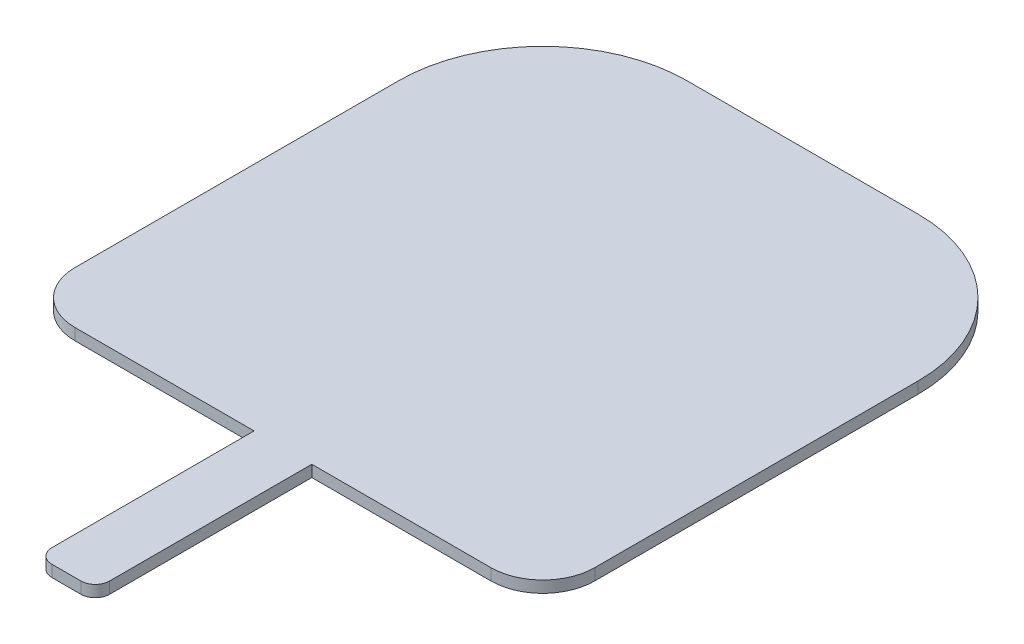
ISO-10303-21;
HEADER;
FILE_DESCRIPTION(('STEP AP214'),'2;1');
FILE_NAME('part.step','',(''),(''),'','','');
FILE_SCHEMA(('AUTOMOTIVE_DESIGN { 1 0 10303 214 1 1 1 1 }'));
ENDSEC;
DATA;
#1=APPLICATION_CONTEXT('core data for automotive mechanical design processes');
#2=APPLICATION_PROTOCOL_DEFINITION('international standard','automotive_design',2000,#1);
#3=PRODUCT_CONTEXT('',#1,'mechanical');
#4=PRODUCT('Part','Part','',(#3));
#5=PRODUCT_RELATED_PRODUCT_CATEGORY('part','',(#4));
#6=PRODUCT_DEFINITION_FORMATION('','',#4);
#7=PRODUCT_DEFINITION_CONTEXT('part definition',#1,'design');
#8=PRODUCT_DEFINITION('design','',#6,#7);
#9=PRODUCT_DEFINITION_SHAPE('','',#8);
#10=(LENGTH_UNIT() NAMED_UNIT(*) SI_UNIT(.MILLI.,.METRE.));
#11=(NAMED_UNIT(*) PLANE_ANGLE_UNIT() SI_UNIT($,.RADIAN.));
#12=(NAMED_UNIT(*) SI_UNIT($,.STERADIAN.) SOLID_ANGLE_UNIT());
#13=UNCERTAINTY_MEASURE_WITH_UNIT(LENGTH_MEASURE(1.E-05),#10,'distance_accuracy_value','');
#14=(GEOMETRIC_REPRESENTATION_CONTEXT(3) GLOBAL_UNCERTAINTY_ASSIGNED_CONTEXT((#13)) GLOBAL_UNIT_ASSIGNED_CONTEXT((#10,
#11,#12)) REPRESENTATION_CONTEXT('',''));
#15=CARTESIAN_POINT('',(0.,0.,0.));
#16=DIRECTION('',(0.,0.,1.));
#17=DIRECTION('',(1.,0.,0.));
#18=AXIS2_PLACEMENT_3D('',#15,#16,#17);
#19=CARTESIAN_POINT('',(-180.,8.,180.));
#20=DIRECTION('',(0.,0.,-1.));
#21=DIRECTION('',(-1.,0.,0.));
#22=AXIS2_PLACEMENT_3D('',#19,#20,#21);
#23=PLANE('',#22);
#24=DIRECTION('',(1.,0.,0.));
#25=VECTOR('',#24,1.);
#26=CARTESIAN_POINT('',(-180.,8.,180.));
#27=LINE('',#26,#25);
#28=CARTESIAN_POINT('',(-144.,8.,180.));
#29=VERTEX_POINT('',#28);
#30=CARTESIAN_POINT('',(-20.,8.,180.));
#31=VERTEX_POINT('',#30);
#32=EDGE_CURVE('E162',#29,#31,#27,.T.);
#33=ORIENTED_EDGE('',*,*,#32,.F.);
#34=DIRECTION('',(0.,-1.,0.));
#35=VECTOR('',#34,1.);
#36=CARTESIAN_POINT('',(-144.,8.,180.));
#37=LINE('',#36,#35);
#38=CARTESIAN_POINT('',(-144.,0.,180.));
#39=VERTEX_POINT('',#38);
#40=EDGE_CURVE('E189',#29,#39,#37,.T.);
#41=ORIENTED_EDGE('',*,*,#40,.T.);
#42=DIRECTION('',(1.,0.,0.));
#43=VECTOR('',#42,1.);
#44=CARTESIAN_POINT('',(-180.,0.,180.));
#45=LINE('',#44,#43);
#46=CARTESIAN_POINT('',(-20.,0.,180.));
#47=VERTEX_POINT('',#46);
#48=EDGE_CURVE('E212',#39,#47,#45,.T.);
#49=ORIENTED_EDGE('',*,*,#48,.T.);
#50=DIRECTION('',(0.,-1.,0.));
#51=VECTOR('',#50,1.);
#52=CARTESIAN_POINT('',(-20.,8.,180.));
#53=LINE('',#52,#51);
#54=EDGE_CURVE('E146',#31,#47,#53,.T.);
#55=ORIENTED_EDGE('',*,*,#54,.F.);
#56=EDGE_LOOP('',(#33,#41,#49,#55));
#57=FACE_BOUND('',#56,.T.);
#58=ADVANCED_FACE('F33',(#57),#23,.F.);
#59=CARTESIAN_POINT('',(180.,8.,180.));
#60=DIRECTION('',(-1.,0.,0.));
#61=DIRECTION('',(0.,0.,1.));
#62=AXIS2_PLACEMENT_3D('',#59,#60,#61);
#63=PLANE('',#62);
#64=DIRECTION('',(0.,0.,-1.));
#65=VECTOR('',#64,1.);
#66=CARTESIAN_POINT('',(180.,8.,180.));
#67=LINE('',#66,#65);
#68=CARTESIAN_POINT('',(180.,8.,144.));
#69=VERTEX_POINT('',#68);
#70=CARTESIAN_POINT('',(180.,8.,-79.9999999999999));
#71=VERTEX_POINT('',#70);
#72=EDGE_CURVE('E211',#69,#71,#67,.T.);
#73=ORIENTED_EDGE('',*,*,#72,.F.);
#74=DIRECTION('',(0.,-1.,0.));
#75=VECTOR('',#74,1.);
#76=CARTESIAN_POINT('',(180.,8.,144.));
#77=LINE('',#76,#75);
#78=CARTESIAN_POINT('',(180.,0.,144.));
#79=VERTEX_POINT('',#78);
#80=EDGE_CURVE('E236',#69,#79,#77,.T.);
#81=ORIENTED_EDGE('',*,*,#80,.T.);
#82=DIRECTION('',(0.,0.,-1.));
#83=VECTOR('',#82,1.);
#84=CARTESIAN_POINT('',(180.,0.,180.));
#85=LINE('',#84,#83);
#86=CARTESIAN_POINT('',(180.,0.,-79.9999999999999));
#87=VERTEX_POINT('',#86);
#88=EDGE_CURVE('E157',#79,#87,#85,.T.);
#89=ORIENTED_EDGE('',*,*,#88,.T.);
#90=DIRECTION('',(0.,-1.,0.));
#91=VECTOR('',#90,1.);
#92=CARTESIAN_POINT('',(180.,8.,-80.));
#93=LINE('',#92,#91);
#94=EDGE_CURVE('E229',#87,#71,#93,.F.);
#95=ORIENTED_EDGE('',*,*,#94,.T.);
#96=EDGE_LOOP('',(#73,#81,#89,#95));
#97=FACE_BOUND('',#96,.T.);
#98=ADVANCED_FACE('F271',(#97),#63,.F.);
#99=CARTESIAN_POINT('',(-180.,8.,-180.));
#100=DIRECTION('',(0.,0.,1.));
#101=DIRECTION('',(1.,0.,0.));
#102=AXIS2_PLACEMENT_3D('',#99,#100,#101);
#103=PLANE('',#102);
#104=DIRECTION('',(-1.,0.,0.));
#105=VECTOR('',#104,1.);
#106=CARTESIAN_POINT('',(-180.,8.,-180.));
#107=LINE('',#106,#105);
#108=CARTESIAN_POINT('',(79.9999999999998,8.,-180.));
#109=VERTEX_POINT('',#108);
#110=CARTESIAN_POINT('',(-80.0000000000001,8.,-180.));
#111=VERTEX_POINT('',#110);
#112=EDGE_CURVE('E168',#109,#111,#107,.T.);
#113=ORIENTED_EDGE('',*,*,#112,.F.);
#114=DIRECTION('',(0.,-1.,0.));
#115=VECTOR('',#114,1.);
#116=CARTESIAN_POINT('',(80.,8.,-180.));
#117=LINE('',#116,#115);
#118=CARTESIAN_POINT('',(79.9999999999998,0.,-180.));
#119=VERTEX_POINT('',#118);
#120=EDGE_CURVE('E259',#109,#119,#117,.T.);
#121=ORIENTED_EDGE('',*,*,#120,.T.);
#122=DIRECTION('',(-1.,0.,0.));
#123=VECTOR('',#122,1.);
#124=CARTESIAN_POINT('',(-180.,0.,-180.));
#125=LINE('',#124,#123);
#126=CARTESIAN_POINT('',(-80.0000000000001,0.,-180.));
#127=VERTEX_POINT('',#126);
#128=EDGE_CURVE('E268',#119,#127,#125,.T.);
#129=ORIENTED_EDGE('',*,*,#128,.T.);
#130=DIRECTION('',(0.,-1.,0.));
#131=VECTOR('',#130,1.);
#132=CARTESIAN_POINT('',(-80.,8.,-180.));
#133=LINE('',#132,#131);
#134=EDGE_CURVE('E165',#127,#111,#133,.F.);
#135=ORIENTED_EDGE('',*,*,#134,.T.);
#136=EDGE_LOOP('',(#113,#121,#129,#135));
#137=FACE_BOUND('',#136,.T.);
#138=ADVANCED_FACE('F294',(#137),#103,.F.);
#139=CARTESIAN_POINT('',(-180.,8.,180.));
#140=DIRECTION('',(1.,0.,0.));
#141=DIRECTION('',(0.,0.,-1.));
#142=AXIS2_PLACEMENT_3D('',#139,#140,#141);
#143=PLANE('',#142);
#144=DIRECTION('',(0.,0.,1.));
#145=VECTOR('',#144,1.);
#146=CARTESIAN_POINT('',(-180.,0.,180.));
#147=LINE('',#146,#145);
#148=CARTESIAN_POINT('',(-180.,0.,-79.9999999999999));
#149=VERTEX_POINT('',#148);
#150=CARTESIAN_POINT('',(-180.,0.,144.));
#151=VERTEX_POINT('',#150);
#152=EDGE_CURVE('E256',#149,#151,#147,.T.);
#153=ORIENTED_EDGE('',*,*,#152,.T.);
#154=DIRECTION('',(0.,-1.,0.));
#155=VECTOR('',#154,1.);
#156=CARTESIAN_POINT('',(-180.,8.,144.));
#157=LINE('',#156,#155);
#158=CARTESIAN_POINT('',(-180.,8.,144.));
#159=VERTEX_POINT('',#158);
#160=EDGE_CURVE('E192',#151,#159,#157,.F.);
#161=ORIENTED_EDGE('',*,*,#160,.T.);
#162=DIRECTION('',(0.,0.,1.));
#163=VECTOR('',#162,1.);
#164=CARTESIAN_POINT('',(-180.,8.,180.));
#165=LINE('',#164,#163);
#166=CARTESIAN_POINT('',(-180.,8.,-79.9999999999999));
#167=VERTEX_POINT('',#166);
#168=EDGE_CURVE('E163',#167,#159,#165,.T.);
#169=ORIENTED_EDGE('',*,*,#168,.F.);
#170=DIRECTION('',(0.,-1.,0.));
#171=VECTOR('',#170,1.);
#172=CARTESIAN_POINT('',(-180.,8.,-80.));
#173=LINE('',#172,#171);
#174=EDGE_CURVE('E228',#167,#149,#173,.T.);
#175=ORIENTED_EDGE('',*,*,#174,.T.);
#176=EDGE_LOOP('',(#153,#161,#169,#175));
#177=FACE_BOUND('',#176,.T.);
#178=ADVANCED_FACE('F300',(#177),#143,.F.);
#179=CARTESIAN_POINT('',(19.9999999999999,0.,180.));
#180=VERTEX_POINT('',#179);
#181=CARTESIAN_POINT('',(144.,0.,180.));
#182=VERTEX_POINT('',#181);
#183=EDGE_CURVE('E172',#180,#182,#45,.T.);
#184=ORIENTED_EDGE('',*,*,#183,.T.);
#185=DIRECTION('',(0.,-1.,0.));
#186=VECTOR('',#185,1.);
#187=CARTESIAN_POINT('',(144.,8.,180.));
#188=LINE('',#187,#186);
#189=CARTESIAN_POINT('',(144.,8.,180.));
#190=VERTEX_POINT('',#189);
#191=EDGE_CURVE('E161',#182,#190,#188,.F.);
#192=ORIENTED_EDGE('',*,*,#191,.T.);
#193=CARTESIAN_POINT('',(19.9999999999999,8.,180.));
#194=VERTEX_POINT('',#193);
#195=EDGE_CURVE('E140',#194,#190,#27,.T.);
#196=ORIENTED_EDGE('',*,*,#195,.F.);
#197=DIRECTION('',(0.,-1.,0.));
#198=VECTOR('',#197,1.);
#199=CARTESIAN_POINT('',(19.9999999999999,8.,180.));
#200=LINE('',#199,#198);
#201=EDGE_CURVE('E150',#194,#180,#200,.T.);
#202=ORIENTED_EDGE('',*,*,#201,.T.);
#203=EDGE_LOOP('',(#184,#192,#196,#202));
#204=FACE_BOUND('',#203,.T.);
#205=ADVANCED_FACE('F159',(#204),#23,.F.);
#206=CARTESIAN_POINT('',(0.,8.,0.));
#207=DIRECTION('',(0.,-1.,0.));
#208=DIRECTION('',(0.,0.,-1.));
#209=AXIS2_PLACEMENT_3D('',#206,#207,#208);
#210=PLANE('',#209);
#211=DIRECTION('',(1.,0.,0.));
#212=VECTOR('',#211,1.);
#213=CARTESIAN_POINT('',(-20.,8.,330.));
#214=LINE('',#213,#212);
#215=CARTESIAN_POINT('',(-10.,8.,330.));
#216=VERTEX_POINT('',#215);
#217=CARTESIAN_POINT('',(9.99999999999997,8.,330.));
#218=VERTEX_POINT('',#217);
#219=EDGE_CURVE('E147',#216,#218,#214,.T.);
#220=ORIENTED_EDGE('',*,*,#219,.T.);
#221=CARTESIAN_POINT('',(9.99999999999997,8.,320.));
#222=DIRECTION('',(0.,-1.,0.));
#223=DIRECTION('',(0.,0.,-1.));
#224=AXIS2_PLACEMENT_3D('',#221,#222,#223);
#225=CIRCLE('',#224,10.);
#226=CARTESIAN_POINT('',(20.,8.,320.));
#227=VERTEX_POINT('',#226);
#228=EDGE_CURVE('E41',#218,#227,#225,.F.);
#229=ORIENTED_EDGE('',*,*,#228,.T.);
#230=DIRECTION('',(0.,0.,-1.));
#231=VECTOR('',#230,1.);
#232=CARTESIAN_POINT('',(19.9999999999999,8.,180.));
#233=LINE('',#232,#231);
#234=EDGE_CURVE('E136',#227,#194,#233,.T.);
#235=ORIENTED_EDGE('',*,*,#234,.T.);
#236=ORIENTED_EDGE('',*,*,#195,.T.);
#237=CARTESIAN_POINT('',(144.,8.,144.));
#238=DIRECTION('',(0.,-1.,0.));
#239=DIRECTION('',(0.,0.,-1.));
#240=AXIS2_PLACEMENT_3D('',#237,#238,#239);
#241=CIRCLE('',#240,36.);
#242=EDGE_CURVE('E187',#190,#69,#241,.F.);
#243=ORIENTED_EDGE('',*,*,#242,.T.);
#244=ORIENTED_EDGE('',*,*,#72,.T.);
#245=CARTESIAN_POINT('',(80.,8.,-80.));
#246=DIRECTION('',(0.,-1.,0.));
#247=DIRECTION('',(0.,0.,-1.));
#248=AXIS2_PLACEMENT_3D('',#245,#246,#247);
#249=CIRCLE('',#248,100.);
#250=EDGE_CURVE('E219',#71,#109,#249,.F.);
#251=ORIENTED_EDGE('',*,*,#250,.T.);
#252=ORIENTED_EDGE('',*,*,#112,.T.);
#253=CARTESIAN_POINT('',(-80.,8.,-80.));
#254=DIRECTION('',(0.,-1.,0.));
#255=DIRECTION('',(0.,0.,-1.));
#256=AXIS2_PLACEMENT_3D('',#253,#254,#255);
#257=CIRCLE('',#256,100.);
#258=EDGE_CURVE('E216',#111,#167,#257,.F.);
#259=ORIENTED_EDGE('',*,*,#258,.T.);
#260=ORIENTED_EDGE('',*,*,#168,.T.);
#261=CARTESIAN_POINT('',(-144.,8.,144.));
#262=DIRECTION('',(0.,-1.,0.));
#263=DIRECTION('',(0.,0.,-1.));
#264=AXIS2_PLACEMENT_3D('',#261,#262,#263);
#265=CIRCLE('',#264,36.);
#266=EDGE_CURVE('E185',#159,#29,#265,.F.);
#267=ORIENTED_EDGE('',*,*,#266,.T.);
#268=ORIENTED_EDGE('',*,*,#32,.T.);
#269=DIRECTION('',(0.,0.,1.));
#270=VECTOR('',#269,1.);
#271=CARTESIAN_POINT('',(-20.,8.,180.));
#272=LINE('',#271,#270);
#273=CARTESIAN_POINT('',(-20.,8.,320.));
#274=VERTEX_POINT('',#273);
#275=EDGE_CURVE('E195',#31,#274,#272,.T.);
#276=ORIENTED_EDGE('',*,*,#275,.T.);
#277=CARTESIAN_POINT('',(-10.,8.,320.));
#278=DIRECTION('',(0.,-1.,0.));
#279=DIRECTION('',(0.,0.,-1.));
#280=AXIS2_PLACEMENT_3D('',#277,#278,#279);
#281=CIRCLE('',#280,10.);
#282=EDGE_CURVE('E415',#274,#216,#281,.F.);
#283=ORIENTED_EDGE('',*,*,#282,.T.);
#284=EDGE_LOOP('',(#220,#229,#235,#236,#243,#244,#251,#252,#259,#260,#267,#268,#276,#283));
#285=FACE_BOUND('',#284,.T.);
#286=ADVANCED_FACE('F138',(#285),#210,.F.);
#287=CARTESIAN_POINT('',(0.,0.,0.));
#288=DIRECTION('',(0.,-1.,0.));
#289=DIRECTION('',(0.,0.,-1.));
#290=AXIS2_PLACEMENT_3D('',#287,#288,#289);
#291=PLANE('',#290);
#292=DIRECTION('',(0.,0.,-1.));
#293=VECTOR('',#292,1.);
#294=CARTESIAN_POINT('',(19.9999999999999,0.,180.));
#295=LINE('',#294,#293);
#296=CARTESIAN_POINT('',(20.,0.,320.));
#297=VERTEX_POINT('',#296);
#298=EDGE_CURVE('E153',#297,#180,#295,.T.);
#299=ORIENTED_EDGE('',*,*,#298,.F.);
#300=CARTESIAN_POINT('',(9.99999999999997,0.,320.));
#301=DIRECTION('',(0.,-1.,0.));
#302=DIRECTION('',(0.,0.,-1.));
#303=AXIS2_PLACEMENT_3D('',#300,#301,#302);
#304=CIRCLE('',#303,10.);
#305=CARTESIAN_POINT('',(9.99999999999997,0.,330.));
#306=VERTEX_POINT('',#305);
#307=EDGE_CURVE('E422',#297,#306,#304,.T.);
#308=ORIENTED_EDGE('',*,*,#307,.T.);
#309=DIRECTION('',(1.,0.,0.));
#310=VECTOR('',#309,1.);
#311=CARTESIAN_POINT('',(-20.,0.,330.));
#312=LINE('',#311,#310);
#313=CARTESIAN_POINT('',(-10.,0.,330.));
#314=VERTEX_POINT('',#313);
#315=EDGE_CURVE('E196',#314,#306,#312,.T.);
#316=ORIENTED_EDGE('',*,*,#315,.F.);
#317=CARTESIAN_POINT('',(-10.,0.,320.));
#318=DIRECTION('',(0.,-1.,0.));
#319=DIRECTION('',(0.,0.,-1.));
#320=AXIS2_PLACEMENT_3D('',#317,#318,#319);
#321=CIRCLE('',#320,10.);
#322=CARTESIAN_POINT('',(-20.,0.,320.));
#323=VERTEX_POINT('',#322);
#324=EDGE_CURVE('E424',#314,#323,#321,.T.);
#325=ORIENTED_EDGE('',*,*,#324,.T.);
#326=DIRECTION('',(0.,0.,1.));
#327=VECTOR('',#326,1.);
#328=CARTESIAN_POINT('',(-20.,0.,180.));
#329=LINE('',#328,#327);
#330=EDGE_CURVE('E426',#47,#323,#329,.T.);
#331=ORIENTED_EDGE('',*,*,#330,.F.);
#332=ORIENTED_EDGE('',*,*,#48,.F.);
#333=CARTESIAN_POINT('',(-144.,0.,144.));
#334=DIRECTION('',(0.,-1.,0.));
#335=DIRECTION('',(0.,0.,-1.));
#336=AXIS2_PLACEMENT_3D('',#333,#334,#335);
#337=CIRCLE('',#336,36.);
#338=EDGE_CURVE('E241',#39,#151,#337,.T.);
#339=ORIENTED_EDGE('',*,*,#338,.T.);
#340=ORIENTED_EDGE('',*,*,#152,.F.);
#341=CARTESIAN_POINT('',(-80.,0.,-80.));
#342=DIRECTION('',(0.,-1.,0.));
#343=DIRECTION('',(0.,0.,-1.));
#344=AXIS2_PLACEMENT_3D('',#341,#342,#343);
#345=CIRCLE('',#344,100.);
#346=EDGE_CURVE('E261',#149,#127,#345,.T.);
#347=ORIENTED_EDGE('',*,*,#346,.T.);
#348=ORIENTED_EDGE('',*,*,#128,.F.);
#349=CARTESIAN_POINT('',(80.,0.,-80.));
#350=DIRECTION('',(0.,-1.,0.));
#351=DIRECTION('',(0.,0.,-1.));
#352=AXIS2_PLACEMENT_3D('',#349,#350,#351);
#353=CIRCLE('',#352,100.);
#354=EDGE_CURVE('E233',#119,#87,#353,.T.);
#355=ORIENTED_EDGE('',*,*,#354,.T.);
#356=ORIENTED_EDGE('',*,*,#88,.F.);
#357=CARTESIAN_POINT('',(144.,0.,144.));
#358=DIRECTION('',(0.,-1.,0.));
#359=DIRECTION('',(0.,0.,-1.));
#360=AXIS2_PLACEMENT_3D('',#357,#358,#359);
#361=CIRCLE('',#360,36.);
#362=EDGE_CURVE('E247',#79,#182,#361,.T.);
#363=ORIENTED_EDGE('',*,*,#362,.T.);
#364=ORIENTED_EDGE('',*,*,#183,.F.);
#365=EDGE_LOOP('',(#299,#308,#316,#325,#331,#332,#339,#340,#347,#348,#355,#356,#363,#364));
#366=FACE_BOUND('',#365,.T.);
#367=ADVANCED_FACE('F266',(#366),#291,.T.);
#368=CARTESIAN_POINT('',(80.,8.,-80.));
#369=DIRECTION('',(0.,-1.,0.));
#370=DIRECTION('',(0.,0.,-1.));
#371=AXIS2_PLACEMENT_3D('',#368,#369,#370);
#372=CYLINDRICAL_SURFACE('',#371,100.);
#373=ORIENTED_EDGE('',*,*,#250,.F.);
#374=ORIENTED_EDGE('',*,*,#94,.F.);
#375=ORIENTED_EDGE('',*,*,#354,.F.);
#376=ORIENTED_EDGE('',*,*,#120,.F.);
#377=EDGE_LOOP('',(#373,#374,#375,#376));
#378=FACE_BOUND('',#377,.T.);
#379=ADVANCED_FACE('F270',(#378),#372,.T.);
#380=CARTESIAN_POINT('',(-80.,8.,-80.));
#381=DIRECTION('',(0.,-1.,0.));
#382=DIRECTION('',(0.,0.,-1.));
#383=AXIS2_PLACEMENT_3D('',#380,#381,#382);
#384=CYLINDRICAL_SURFACE('',#383,100.);
#385=ORIENTED_EDGE('',*,*,#258,.F.);
#386=ORIENTED_EDGE('',*,*,#134,.F.);
#387=ORIENTED_EDGE('',*,*,#346,.F.);
#388=ORIENTED_EDGE('',*,*,#174,.F.);
#389=EDGE_LOOP('',(#385,#386,#387,#388));
#390=FACE_BOUND('',#389,.T.);
#391=ADVANCED_FACE('F226',(#390),#384,.T.);
#392=CARTESIAN_POINT('',(-20.,8.,180.));
#393=DIRECTION('',(1.,0.,0.));
#394=DIRECTION('',(0.,0.,-1.));
#395=AXIS2_PLACEMENT_3D('',#392,#393,#394);
#396=PLANE('',#395);
#397=ORIENTED_EDGE('',*,*,#330,.T.);
#398=DIRECTION('',(0.,-1.,0.));
#399=VECTOR('',#398,1.);
#400=CARTESIAN_POINT('',(-20.,8.,320.));
#401=LINE('',#400,#399);
#402=EDGE_CURVE('E11',#323,#274,#401,.F.);
#403=ORIENTED_EDGE('',*,*,#402,.T.);
#404=ORIENTED_EDGE('',*,*,#275,.F.);
#405=ORIENTED_EDGE('',*,*,#54,.T.);
#406=EDGE_LOOP('',(#397,#403,#404,#405));
#407=FACE_BOUND('',#406,.T.);
#408=ADVANCED_FACE('F313',(#407),#396,.F.);
#409=CARTESIAN_POINT('',(-20.,8.,330.));
#410=DIRECTION('',(0.,0.,-1.));
#411=DIRECTION('',(-1.,0.,0.));
#412=AXIS2_PLACEMENT_3D('',#409,#410,#411);
#413=PLANE('',#412);
#414=ORIENTED_EDGE('',*,*,#315,.T.);
#415=DIRECTION('',(0.,-1.,0.));
#416=VECTOR('',#415,1.);
#417=CARTESIAN_POINT('',(9.99999999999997,8.,330.));
#418=LINE('',#417,#416);
#419=EDGE_CURVE('E54',#306,#218,#418,.F.);
#420=ORIENTED_EDGE('',*,*,#419,.T.);
#421=ORIENTED_EDGE('',*,*,#219,.F.);
#422=DIRECTION('',(0.,-1.,0.));
#423=VECTOR('',#422,1.);
#424=CARTESIAN_POINT('',(-10.,8.,330.));
#425=LINE('',#424,#423);
#426=EDGE_CURVE('E417',#216,#314,#425,.T.);
#427=ORIENTED_EDGE('',*,*,#426,.T.);
#428=EDGE_LOOP('',(#414,#420,#421,#427));
#429=FACE_BOUND('',#428,.T.);
#430=ADVANCED_FACE('F285',(#429),#413,.F.);
#431=CARTESIAN_POINT('',(19.9999999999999,8.,180.));
#432=DIRECTION('',(-1.,0.,0.));
#433=DIRECTION('',(0.,0.,1.));
#434=AXIS2_PLACEMENT_3D('',#431,#432,#433);
#435=PLANE('',#434);
#436=ORIENTED_EDGE('',*,*,#234,.F.);
#437=DIRECTION('',(0.,-1.,0.));
#438=VECTOR('',#437,1.);
#439=CARTESIAN_POINT('',(20.,8.,320.));
#440=LINE('',#439,#438);
#441=EDGE_CURVE('E194',#227,#297,#440,.T.);
#442=ORIENTED_EDGE('',*,*,#441,.T.);
#443=ORIENTED_EDGE('',*,*,#298,.T.);
#444=ORIENTED_EDGE('',*,*,#201,.F.);
#445=EDGE_LOOP('',(#436,#442,#443,#444));
#446=FACE_BOUND('',#445,.T.);
#447=ADVANCED_FACE('F151',(#446),#435,.F.);
#448=CARTESIAN_POINT('',(144.,8.,144.));
#449=DIRECTION('',(0.,-1.,0.));
#450=DIRECTION('',(0.,0.,-1.));
#451=AXIS2_PLACEMENT_3D('',#448,#449,#450);
#452=CYLINDRICAL_SURFACE('',#451,36.);
#453=ORIENTED_EDGE('',*,*,#242,.F.);
#454=ORIENTED_EDGE('',*,*,#191,.F.);
#455=ORIENTED_EDGE('',*,*,#362,.F.);
#456=ORIENTED_EDGE('',*,*,#80,.F.);
#457=EDGE_LOOP('',(#453,#454,#455,#456));
#458=FACE_BOUND('',#457,.T.);
#459=ADVANCED_FACE('F274',(#458),#452,.T.);
#460=CARTESIAN_POINT('',(-144.,8.,144.));
#461=DIRECTION('',(0.,-1.,0.));
#462=DIRECTION('',(0.,0.,-1.));
#463=AXIS2_PLACEMENT_3D('',#460,#461,#462);
#464=CYLINDRICAL_SURFACE('',#463,36.);
#465=ORIENTED_EDGE('',*,*,#266,.F.);
#466=ORIENTED_EDGE('',*,*,#160,.F.);
#467=ORIENTED_EDGE('',*,*,#338,.F.);
#468=ORIENTED_EDGE('',*,*,#40,.F.);
#469=EDGE_LOOP('',(#465,#466,#467,#468));
#470=FACE_BOUND('',#469,.T.);
#471=ADVANCED_FACE('F276',(#470),#464,.T.);
#472=CARTESIAN_POINT('',(9.99999999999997,8.,320.));
#473=DIRECTION('',(0.,-1.,0.));
#474=DIRECTION('',(0.,0.,-1.));
#475=AXIS2_PLACEMENT_3D('',#472,#473,#474);
#476=CYLINDRICAL_SURFACE('',#475,10.);
#477=ORIENTED_EDGE('',*,*,#228,.F.);
#478=ORIENTED_EDGE('',*,*,#419,.F.);
#479=ORIENTED_EDGE('',*,*,#307,.F.);
#480=ORIENTED_EDGE('',*,*,#441,.F.);
#481=EDGE_LOOP('',(#477,#478,#479,#480));
#482=FACE_BOUND('',#481,.T.);
#483=ADVANCED_FACE('F282',(#482),#476,.T.);
#484=CARTESIAN_POINT('',(-10.,8.,320.));
#485=DIRECTION('',(0.,-1.,0.));
#486=DIRECTION('',(0.,0.,-1.));
#487=AXIS2_PLACEMENT_3D('',#484,#485,#486);
#488=CYLINDRICAL_SURFACE('',#487,10.);
#489=ORIENTED_EDGE('',*,*,#282,.F.);
#490=ORIENTED_EDGE('',*,*,#402,.F.);
#491=ORIENTED_EDGE('',*,*,#324,.F.);
#492=ORIENTED_EDGE('',*,*,#426,.F.);
#493=EDGE_LOOP('',(#489,#490,#491,#492));
#494=FACE_BOUND('',#493,.T.);
#495=ADVANCED_FACE('F35',(#494),#488,.T.);
#496=CLOSED_SHELL('',(#58,#98,#138,#178,#205,#286,#367,#379,#391,#408,#430,#447,#459,#471,#483,#495));
#497=MANIFOLD_SOLID_BREP('B2',#496);
#498=ADVANCED_BREP_SHAPE_REPRESENTATION('',(#18,#497),#14);
#499=SHAPE_DEFINITION_REPRESENTATION(#9,#498);
ENDSEC;
END-ISO-10303-21;
